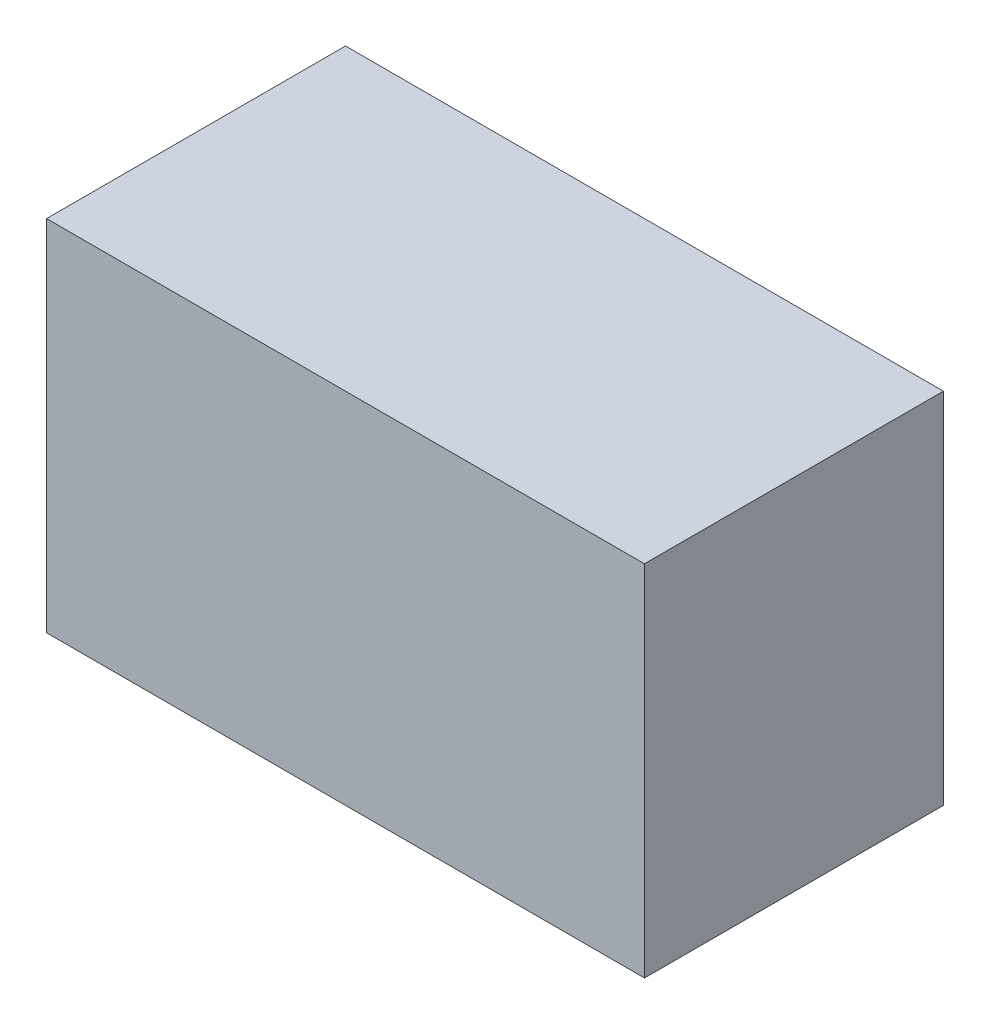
from build123d import *

# Parameters (mm, degrees)
ESQUISSE1_W          = 30
ESQUISSE1_H          = 18
BASE_EXTRUSION_DEPTH = 15


with BuildPart() as part:
    # Esquisse1 → Base-Extrusion (new body)
    with BuildSketch(Plane.XY):
        Rectangle(ESQUISSE1_W, ESQUISSE1_H)
    extrude(amount=BASE_EXTRUSION_DEPTH)


solid = part.part
